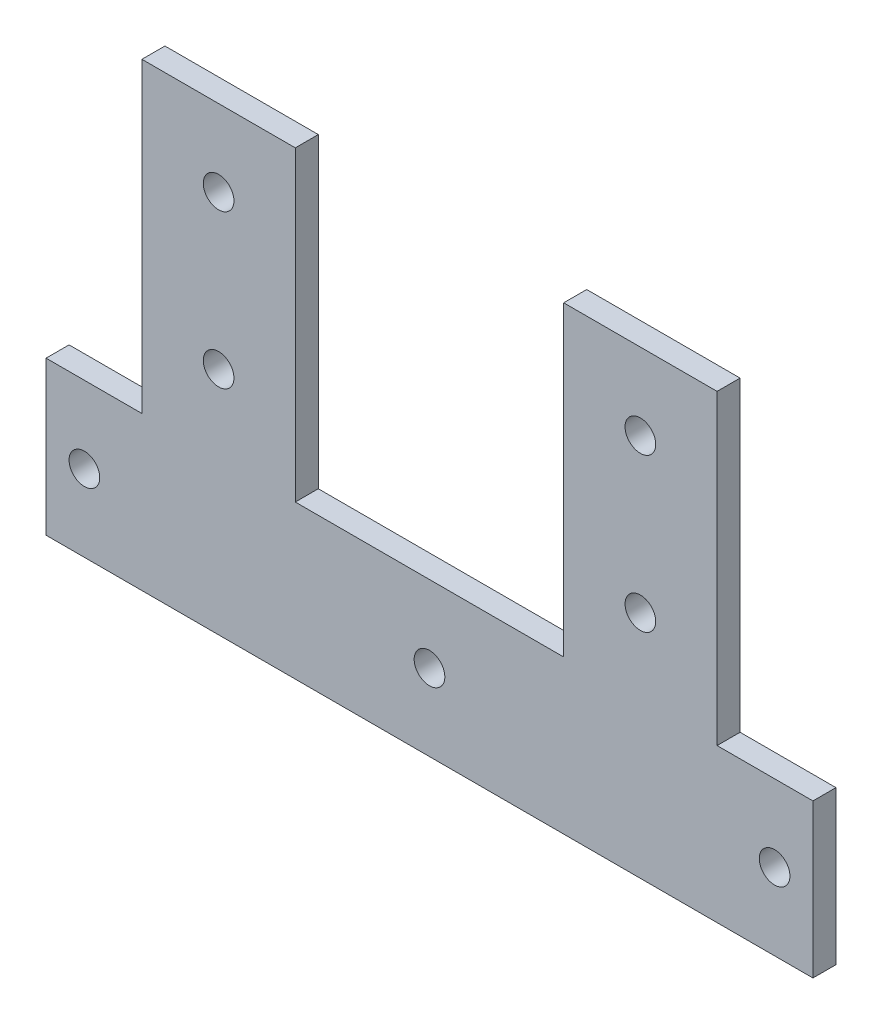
from build123d import *

# Parameters (mm, degrees)
EXTRUDE_1_DEPTH       = 3
HOLE_WIZARD_4_0_4_1_D = 4


with BuildPart() as part:
    # Sketch 1 → Extrude 1 (new body)
    with BuildSketch(Plane.XY):
        Polygon((17.5, 10), (17.5, 50), (37.5, 50), (37.5, 10), (50, 10), (50, -10), (-50, -10), (-50, 10), (-37.5, 10), (-37.5, 50), (-17.5, 50), (-17.5, 10), align=None)
    extrude(amount=EXTRUDE_1_DEPTH)

    # Hole Wizard 4.0 _4_ _1 (through all)
    with Locations(Plane.XY.offset(3)):
        with Locations((27.5, 40), (27.5, 20), (0, 0), (-27.5, 40), (-27.5, 20), (-45, 0), (45, 0)):
            Hole(HOLE_WIZARD_4_0_4_1_D / 2)


solid = part.part
